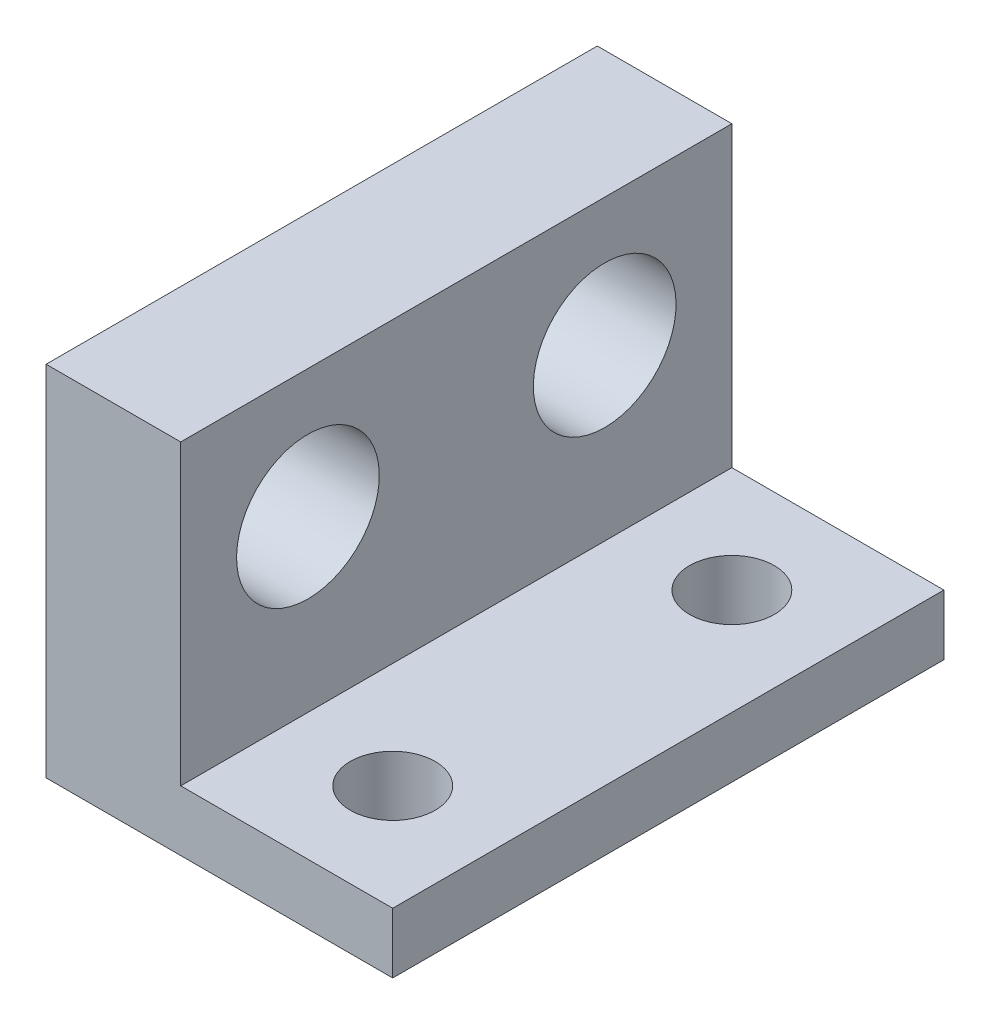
from build123d import *

# Parameters (mm, degrees)
BOSS_EXTRUDE1_DEPTH = 13
CUT_EXTRUDE1_REACH  = 40.201
SKETCH2_R           = 3.3655
SKETCH4_W           = 25.4
SKETCH4_H           = 26
CUT_EXTRUDE3_DEPTH  = 3.5
SKETCH5_W           = 6.35
SKETCH5_H           = 26
CUT_EXTRUDE4_DEPTH  = 5
SKETCH7_W           = 9.05
SKETCH7_H           = 57.5
CUT_EXTRUDE5_DEPTH  = 30
CUT_EXTRUDE2_REACH  = 27.174
SKETCH3_R           = 2


with BuildPart() as part:
    # Sketch1 → Boss-Extrude1 (new, symmetric)
    with BuildSketch(Plane.XY):
        Polygon((0, 25.4), (0, 0), (25.4, 0), (25.4, 6.35), (6.35, 6.35), (6.35, 25.4), align=None)
    extrude(amount=BOSS_EXTRUDE1_DEPTH, both=True)

    # Sketch2 → Cut-Extrude1 (cut, up to next)
    with BuildSketch(Plane.ZY, mode=Mode.PRIVATE) as cut_extrude1_sk1:
        with Locations(Location((-7, 14.35, 0), (0, 0, 270))):
            Circle(SKETCH2_R)
    cut_extrude1_tool1 = extrude(cut_extrude1_sk1.sketch, amount=-CUT_EXTRUDE1_REACH, mode=Mode.PRIVATE) & part.part
    # Sketch2 → Cut-Extrude1 (cut, up to next)
    with BuildSketch(Plane.ZY, mode=Mode.PRIVATE) as cut_extrude1_sk2:
        with Locations(Location((7, 14.35, 0), (0, 0, 270))):
            Circle(SKETCH2_R)
    cut_extrude1_tool2 = extrude(cut_extrude1_sk2.sketch, amount=-CUT_EXTRUDE1_REACH, mode=Mode.PRIVATE) & part.part
    add(cut_extrude1_tool1.solids().sort_by_distance((0, 14.35, -7))[0], mode=Mode.SUBTRACT)
    add(cut_extrude1_tool2.solids().sort_by_distance((0, 14.35, 7))[0], mode=Mode.SUBTRACT)

    # Sketch4 → Cut-Extrude3 (cut)
    with BuildSketch(Plane.XZ):
        with Locations((12.7, 0)):
            Rectangle(SKETCH4_W, SKETCH4_H)
    extrude(amount=-CUT_EXTRUDE3_DEPTH, mode=Mode.SUBTRACT)

    # Sketch5 → Cut-Extrude4 (cut)
    with BuildSketch(Plane(origin=(0, 25.4, 0), x_dir=(1, 0, 0), z_dir=(0, 1, 0))):
        with Locations((3.175, 0)):
            Rectangle(SKETCH5_W, SKETCH5_H)
    extrude(amount=-CUT_EXTRUDE4_DEPTH, mode=Mode.SUBTRACT)

    # Sketch7 → Cut-Extrude5 (cut)
    with BuildSketch(Plane(origin=(0, 6.35, 0), x_dir=(1, 0, 0), z_dir=(0, 1, 0))):
        with Locations((20.875, 15.75)):
            Rectangle(SKETCH7_W, SKETCH7_H)
    extrude(amount=-CUT_EXTRUDE5_DEPTH, mode=Mode.SUBTRACT)

    # Sketch3 → Cut-Extrude2 (cut, up to next)
    with BuildSketch(Plane(origin=(0, 6.35, 0), x_dir=(1, 0, 0), z_dir=(0, 1, 0)), mode=Mode.PRIVATE) as cut_extrude2_sk1:
        with Locations(Location((11.35, -8, 0), (0, 0, 180))):
            Circle(SKETCH3_R)
    cut_extrude2_tool1 = extrude(cut_extrude2_sk1.sketch, amount=-CUT_EXTRUDE2_REACH, mode=Mode.PRIVATE) & part.part
    # Sketch3 → Cut-Extrude2 (cut, up to next)
    with BuildSketch(Plane(origin=(0, 6.35, 0), x_dir=(1, 0, 0), z_dir=(0, 1, 0)), mode=Mode.PRIVATE) as cut_extrude2_sk2:
        with Locations(Location((11.35, 8, 0), (0, 0, 180))):
            Circle(SKETCH3_R)
    cut_extrude2_tool2 = extrude(cut_extrude2_sk2.sketch, amount=-CUT_EXTRUDE2_REACH, mode=Mode.PRIVATE) & part.part
    add(cut_extrude2_tool1.solids().sort_by_distance((11.35, 6.35, 8))[0], mode=Mode.SUBTRACT)
    add(cut_extrude2_tool2.solids().sort_by_distance((11.35, 6.35, -8))[0], mode=Mode.SUBTRACT)


solid = part.part
